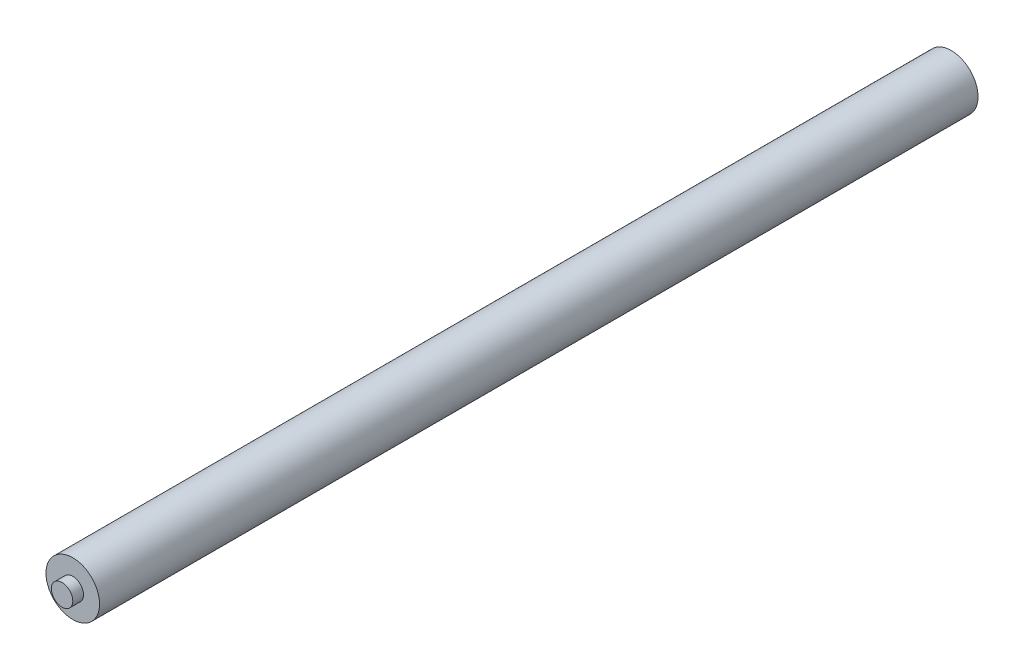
from build123d import *

# Parameters (mm, degrees)
SKETCH1_R           = 12.5
BOSS_EXTRUDE1_DEPTH = 410
SKETCH2_R           = 5
BOSS_EXTRUDE2_DEPTH = 5


with BuildPart() as part:
    # Sketch1 → Boss-Extrude1 (new body)
    with BuildSketch(Plane.XY):
        with Locations(Location((0, 0, 0), (0, 0, 180))):
            Circle(SKETCH1_R)
    extrude(amount=BOSS_EXTRUDE1_DEPTH)

    # Sketch2 → Boss-Extrude2 (add)
    with BuildSketch(Plane.XY.offset(410)):
        Circle(SKETCH2_R)
    extrude(amount=BOSS_EXTRUDE2_DEPTH)


solid = part.part
